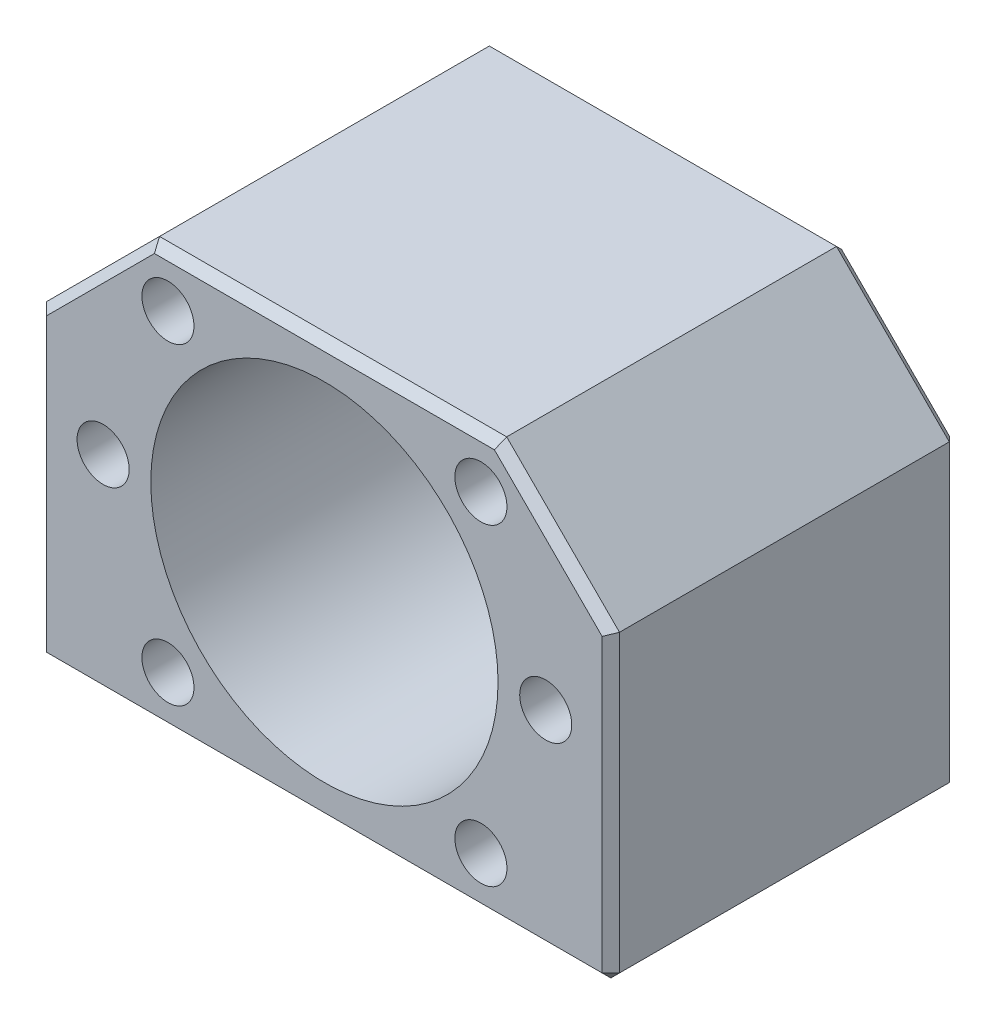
ISO-10303-21;
HEADER;
FILE_DESCRIPTION(('STEP AP214'),'2;1');
FILE_NAME('part.step','',(''),(''),'','','');
FILE_SCHEMA(('AUTOMOTIVE_DESIGN { 1 0 10303 214 1 1 1 1 }'));
ENDSEC;
DATA;
#1=APPLICATION_CONTEXT('core data for automotive mechanical design processes');
#2=APPLICATION_PROTOCOL_DEFINITION('international standard','automotive_design',2000,#1);
#3=PRODUCT_CONTEXT('',#1,'mechanical');
#4=PRODUCT('Part','Part','',(#3));
#5=PRODUCT_RELATED_PRODUCT_CATEGORY('part','',(#4));
#6=PRODUCT_DEFINITION_FORMATION('','',#4);
#7=PRODUCT_DEFINITION_CONTEXT('part definition',#1,'design');
#8=PRODUCT_DEFINITION('design','',#6,#7);
#9=PRODUCT_DEFINITION_SHAPE('','',#8);
#10=(LENGTH_UNIT() NAMED_UNIT(*) SI_UNIT(.MILLI.,.METRE.));
#11=(NAMED_UNIT(*) PLANE_ANGLE_UNIT() SI_UNIT($,.RADIAN.));
#12=(NAMED_UNIT(*) SI_UNIT($,.STERADIAN.) SOLID_ANGLE_UNIT());
#13=UNCERTAINTY_MEASURE_WITH_UNIT(LENGTH_MEASURE(1.E-05),#10,'distance_accuracy_value','');
#14=(GEOMETRIC_REPRESENTATION_CONTEXT(3) GLOBAL_UNCERTAINTY_ASSIGNED_CONTEXT((#13)) GLOBAL_UNIT_ASSIGNED_CONTEXT((#10,
#11,#12)) REPRESENTATION_CONTEXT('',''));
#15=CARTESIAN_POINT('',(0.,0.,0.));
#16=DIRECTION('',(0.,0.,1.));
#17=DIRECTION('',(1.,0.,0.));
#18=AXIS2_PLACEMENT_3D('',#15,#16,#17);
#19=CARTESIAN_POINT('',(25.,-9.,-8.));
#20=DIRECTION('',(0.,-1.,0.));
#21=DIRECTION('',(0.,0.,-1.));
#22=AXIS2_PLACEMENT_3D('',#19,#20,#21);
#23=PLANE('',#22);
#24=CARTESIAN_POINT('',(25.,-9.,-8.));
#25=DIRECTION('',(0.,1.,0.));
#26=DIRECTION('',(0.,0.,1.));
#27=AXIS2_PLACEMENT_3D('',#24,#25,#26);
#28=CIRCLE('',#27,3.);
#29=CARTESIAN_POINT('',(25.,-9.,-5.));
#30=VERTEX_POINT('',#29);
#31=EDGE_CURVE('E18',#30,#30,#28,.F.);
#32=ORIENTED_EDGE('',*,*,#31,.T.);
#33=EDGE_LOOP('',(#32));
#34=FACE_BOUND('',#33,.T.);
#35=ADVANCED_FACE('F15',(#34),#23,.T.);
#36=CARTESIAN_POINT('',(-25.,-9.,-32.));
#37=DIRECTION('',(0.,-1.,0.));
#38=DIRECTION('',(0.,0.,-1.));
#39=AXIS2_PLACEMENT_3D('',#36,#37,#38);
#40=PLANE('',#39);
#41=CARTESIAN_POINT('',(-25.,-9.,-32.));
#42=DIRECTION('',(0.,1.,0.));
#43=DIRECTION('',(0.,0.,1.));
#44=AXIS2_PLACEMENT_3D('',#41,#42,#43);
#45=CIRCLE('',#44,3.);
#46=CARTESIAN_POINT('',(-25.,-9.,-29.));
#47=VERTEX_POINT('',#46);
#48=EDGE_CURVE('E277',#47,#47,#45,.F.);
#49=ORIENTED_EDGE('',*,*,#48,.T.);
#50=EDGE_LOOP('',(#49));
#51=FACE_BOUND('',#50,.T.);
#52=ADVANCED_FACE('F903',(#51),#40,.T.);
#53=CARTESIAN_POINT('',(25.,-9.,-32.));
#54=DIRECTION('',(0.,-1.,0.));
#55=DIRECTION('',(0.,0.,-1.));
#56=AXIS2_PLACEMENT_3D('',#53,#54,#55);
#57=PLANE('',#56);
#58=CARTESIAN_POINT('',(25.,-9.,-32.));
#59=DIRECTION('',(0.,1.,0.));
#60=DIRECTION('',(0.,0.,1.));
#61=AXIS2_PLACEMENT_3D('',#58,#59,#60);
#62=CIRCLE('',#61,3.);
#63=CARTESIAN_POINT('',(25.,-9.,-29.));
#64=VERTEX_POINT('',#63);
#65=EDGE_CURVE('E274',#64,#64,#62,.F.);
#66=ORIENTED_EDGE('',*,*,#65,.T.);
#67=EDGE_LOOP('',(#66));
#68=FACE_BOUND('',#67,.T.);
#69=ADVANCED_FACE('F893',(#68),#57,.T.);
#70=CARTESIAN_POINT('',(-25.,-9.,-8.));
#71=DIRECTION('',(0.,-1.,0.));
#72=DIRECTION('',(0.,0.,-1.));
#73=AXIS2_PLACEMENT_3D('',#70,#71,#72);
#74=PLANE('',#73);
#75=CARTESIAN_POINT('',(-25.,-9.,-8.));
#76=DIRECTION('',(0.,1.,0.));
#77=DIRECTION('',(0.,0.,1.));
#78=AXIS2_PLACEMENT_3D('',#75,#76,#77);
#79=CIRCLE('',#78,3.);
#80=CARTESIAN_POINT('',(-25.,-9.,-5.));
#81=VERTEX_POINT('',#80);
#82=EDGE_CURVE('E150',#81,#81,#79,.F.);
#83=ORIENTED_EDGE('',*,*,#82,.T.);
#84=EDGE_LOOP('',(#83));
#85=FACE_BOUND('',#84,.T.);
#86=ADVANCED_FACE('F883',(#85),#74,.T.);
#87=CARTESIAN_POINT('',(-32.5,-23.5,0.));
#88=DIRECTION('',(-0.707106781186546,-0.707106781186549,0.));
#89=DIRECTION('',(0.707106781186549,-0.707106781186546,0.));
#90=AXIS2_PLACEMENT_3D('',#87,#88,#89);
#91=PLANE('',#90);
#92=DIRECTION('',(0.707106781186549,-0.707106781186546,0.));
#93=VECTOR('',#92,1.);
#94=CARTESIAN_POINT('',(-33.,-23.,-1.));
#95=LINE('',#94,#93);
#96=CARTESIAN_POINT('',(-33.,-23.,-1.));
#97=VERTEX_POINT('',#96);
#98=CARTESIAN_POINT('',(-32.,-24.,-1.));
#99=VERTEX_POINT('',#98);
#100=EDGE_CURVE('E195',#97,#99,#95,.T.);
#101=ORIENTED_EDGE('',*,*,#100,.F.);
#102=DIRECTION('',(0.,0.,1.));
#103=VECTOR('',#102,1.);
#104=CARTESIAN_POINT('',(-33.,-23.,0.));
#105=LINE('',#104,#103);
#106=CARTESIAN_POINT('',(-33.,-23.,-39.));
#107=VERTEX_POINT('',#106);
#108=EDGE_CURVE('E198',#107,#97,#105,.T.);
#109=ORIENTED_EDGE('',*,*,#108,.F.);
#110=DIRECTION('',(-0.707106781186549,0.707106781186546,0.));
#111=VECTOR('',#110,1.);
#112=CARTESIAN_POINT('',(-32.,-24.,-39.));
#113=LINE('',#112,#111);
#114=CARTESIAN_POINT('',(-32.,-24.,-39.));
#115=VERTEX_POINT('',#114);
#116=EDGE_CURVE('E149',#115,#107,#113,.T.);
#117=ORIENTED_EDGE('',*,*,#116,.F.);
#118=DIRECTION('',(0.,0.,-1.));
#119=VECTOR('',#118,1.);
#120=CARTESIAN_POINT('',(-32.,-24.,0.));
#121=LINE('',#120,#119);
#122=EDGE_CURVE('E192',#99,#115,#121,.T.);
#123=ORIENTED_EDGE('',*,*,#122,.F.);
#124=EDGE_LOOP('',(#101,#109,#117,#123));
#125=FACE_BOUND('',#124,.T.);
#126=ADVANCED_FACE('F291',(#125),#91,.T.);
#127=CARTESIAN_POINT('',(25.,-24.,-8.));
#128=DIRECTION('',(0.,1.,0.));
#129=DIRECTION('',(0.,0.,1.));
#130=AXIS2_PLACEMENT_3D('',#127,#128,#129);
#131=CYLINDRICAL_SURFACE('',#130,3.);
#132=ORIENTED_EDGE('',*,*,#31,.F.);
#133=EDGE_LOOP('',(#132));
#134=FACE_BOUND('',#133,.T.);
#135=CARTESIAN_POINT('',(25.,-24.,-8.));
#136=DIRECTION('',(0.,1.,0.));
#137=DIRECTION('',(0.,0.,1.));
#138=AXIS2_PLACEMENT_3D('',#135,#136,#137);
#139=CIRCLE('',#138,3.);
#140=CARTESIAN_POINT('',(25.,-24.,-5.));
#141=VERTEX_POINT('',#140);
#142=EDGE_CURVE('E191',#141,#141,#139,.T.);
#143=ORIENTED_EDGE('',*,*,#142,.F.);
#144=EDGE_LOOP('',(#143));
#145=FACE_BOUND('',#144,.T.);
#146=ADVANCED_FACE('F287',(#134,#145),#131,.F.);
#147=CARTESIAN_POINT('',(-25.,-24.,-32.));
#148=DIRECTION('',(0.,1.,0.));
#149=DIRECTION('',(0.,0.,1.));
#150=AXIS2_PLACEMENT_3D('',#147,#148,#149);
#151=CYLINDRICAL_SURFACE('',#150,3.);
#152=ORIENTED_EDGE('',*,*,#48,.F.);
#153=EDGE_LOOP('',(#152));
#154=FACE_BOUND('',#153,.T.);
#155=CARTESIAN_POINT('',(-25.,-24.,-32.));
#156=DIRECTION('',(0.,1.,0.));
#157=DIRECTION('',(0.,0.,1.));
#158=AXIS2_PLACEMENT_3D('',#155,#156,#157);
#159=CIRCLE('',#158,3.);
#160=CARTESIAN_POINT('',(-25.,-24.,-29.));
#161=VERTEX_POINT('',#160);
#162=EDGE_CURVE('E264',#161,#161,#159,.T.);
#163=ORIENTED_EDGE('',*,*,#162,.F.);
#164=EDGE_LOOP('',(#163));
#165=FACE_BOUND('',#164,.T.);
#166=ADVANCED_FACE('F290',(#154,#165),#151,.F.);
#167=CARTESIAN_POINT('',(25.,-24.,-32.));
#168=DIRECTION('',(0.,1.,0.));
#169=DIRECTION('',(0.,0.,1.));
#170=AXIS2_PLACEMENT_3D('',#167,#168,#169);
#171=CYLINDRICAL_SURFACE('',#170,3.);
#172=ORIENTED_EDGE('',*,*,#65,.F.);
#173=EDGE_LOOP('',(#172));
#174=FACE_BOUND('',#173,.T.);
#175=CARTESIAN_POINT('',(25.,-24.,-32.));
#176=DIRECTION('',(0.,1.,0.));
#177=DIRECTION('',(0.,0.,1.));
#178=AXIS2_PLACEMENT_3D('',#175,#176,#177);
#179=CIRCLE('',#178,3.);
#180=CARTESIAN_POINT('',(25.,-24.,-29.));
#181=VERTEX_POINT('',#180);
#182=EDGE_CURVE('E260',#181,#181,#179,.T.);
#183=ORIENTED_EDGE('',*,*,#182,.F.);
#184=EDGE_LOOP('',(#183));
#185=FACE_BOUND('',#184,.T.);
#186=ADVANCED_FACE('F849',(#174,#185),#171,.F.);
#187=CARTESIAN_POINT('',(-25.,-24.,-8.));
#188=DIRECTION('',(0.,1.,0.));
#189=DIRECTION('',(0.,0.,1.));
#190=AXIS2_PLACEMENT_3D('',#187,#188,#189);
#191=CYLINDRICAL_SURFACE('',#190,3.);
#192=ORIENTED_EDGE('',*,*,#82,.F.);
#193=EDGE_LOOP('',(#192));
#194=FACE_BOUND('',#193,.T.);
#195=CARTESIAN_POINT('',(-25.,-24.,-8.));
#196=DIRECTION('',(0.,1.,0.));
#197=DIRECTION('',(0.,0.,1.));
#198=AXIS2_PLACEMENT_3D('',#195,#196,#197);
#199=CIRCLE('',#198,3.);
#200=CARTESIAN_POINT('',(-25.,-24.,-5.));
#201=VERTEX_POINT('',#200);
#202=EDGE_CURVE('E188',#201,#201,#199,.T.);
#203=ORIENTED_EDGE('',*,*,#202,.F.);
#204=EDGE_LOOP('',(#203));
#205=FACE_BOUND('',#204,.T.);
#206=ADVANCED_FACE('F840',(#194,#205),#191,.F.);
#207=CARTESIAN_POINT('',(32.5,-23.5,0.));
#208=DIRECTION('',(0.707106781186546,-0.707106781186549,0.));
#209=DIRECTION('',(0.707106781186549,0.707106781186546,0.));
#210=AXIS2_PLACEMENT_3D('',#207,#208,#209);
#211=PLANE('',#210);
#212=DIRECTION('',(0.707106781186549,0.707106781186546,0.));
#213=VECTOR('',#212,1.);
#214=CARTESIAN_POINT('',(32.,-24.,-1.));
#215=LINE('',#214,#213);
#216=CARTESIAN_POINT('',(32.,-24.,-1.));
#217=VERTEX_POINT('',#216);
#218=CARTESIAN_POINT('',(33.,-23.,-0.999999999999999));
#219=VERTEX_POINT('',#218);
#220=EDGE_CURVE('E126',#217,#219,#215,.T.);
#221=ORIENTED_EDGE('',*,*,#220,.F.);
#222=DIRECTION('',(0.,0.,-1.));
#223=VECTOR('',#222,1.);
#224=CARTESIAN_POINT('',(32.,-24.,0.));
#225=LINE('',#224,#223);
#226=CARTESIAN_POINT('',(32.,-24.,-39.));
#227=VERTEX_POINT('',#226);
#228=EDGE_CURVE('E143',#227,#217,#225,.F.);
#229=ORIENTED_EDGE('',*,*,#228,.F.);
#230=DIRECTION('',(-0.707106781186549,-0.707106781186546,0.));
#231=VECTOR('',#230,1.);
#232=CARTESIAN_POINT('',(33.,-23.,-39.));
#233=LINE('',#232,#231);
#234=CARTESIAN_POINT('',(33.,-23.,-39.));
#235=VERTEX_POINT('',#234);
#236=EDGE_CURVE('E141',#235,#227,#233,.T.);
#237=ORIENTED_EDGE('',*,*,#236,.F.);
#238=DIRECTION('',(0.,0.,-1.));
#239=VECTOR('',#238,1.);
#240=CARTESIAN_POINT('',(33.,-23.,0.));
#241=LINE('',#240,#239);
#242=EDGE_CURVE('E115',#219,#235,#241,.T.);
#243=ORIENTED_EDGE('',*,*,#242,.F.);
#244=EDGE_LOOP('',(#221,#229,#237,#243));
#245=FACE_BOUND('',#244,.T.);
#246=ADVANCED_FACE('F142',(#245),#211,.T.);
#247=CARTESIAN_POINT('',(32.,-24.,-39.));
#248=DIRECTION('',(0.577350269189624,-0.577350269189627,-0.577350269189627));
#249=DIRECTION('',(0.,0.707106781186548,-0.707106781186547));
#250=AXIS2_PLACEMENT_3D('',#247,#248,#249);
#251=PLANE('',#250);
#252=ORIENTED_EDGE('',*,*,#236,.T.);
#253=DIRECTION('',(0.,0.707106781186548,-0.707106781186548));
#254=VECTOR('',#253,1.);
#255=CARTESIAN_POINT('',(32.,-23.5,-39.5));
#256=LINE('',#255,#254);
#257=CARTESIAN_POINT('',(32.,-23.,-40.));
#258=VERTEX_POINT('',#257);
#259=EDGE_CURVE('E153',#258,#227,#256,.F.);
#260=ORIENTED_EDGE('',*,*,#259,.F.);
#261=DIRECTION('',(-0.707106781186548,0.,-0.707106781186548));
#262=VECTOR('',#261,1.);
#263=CARTESIAN_POINT('',(32.5,-23.,-39.5));
#264=LINE('',#263,#262);
#265=EDGE_CURVE('E133',#235,#258,#264,.T.);
#266=ORIENTED_EDGE('',*,*,#265,.F.);
#267=EDGE_LOOP('',(#252,#260,#266));
#268=FACE_BOUND('',#267,.T.);
#269=ADVANCED_FACE('F152',(#268),#251,.T.);
#270=CARTESIAN_POINT('',(-33.,-23.,-39.));
#271=DIRECTION('',(-0.577350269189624,-0.577350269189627,-0.577350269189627));
#272=DIRECTION('',(0.,0.707106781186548,-0.707106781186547));
#273=AXIS2_PLACEMENT_3D('',#270,#271,#272);
#274=PLANE('',#273);
#275=ORIENTED_EDGE('',*,*,#116,.T.);
#276=DIRECTION('',(-0.707106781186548,0.,0.707106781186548));
#277=VECTOR('',#276,1.);
#278=CARTESIAN_POINT('',(-32.5,-23.,-39.5));
#279=LINE('',#278,#277);
#280=CARTESIAN_POINT('',(-32.,-23.,-40.));
#281=VERTEX_POINT('',#280);
#282=EDGE_CURVE('E310',#281,#107,#279,.T.);
#283=ORIENTED_EDGE('',*,*,#282,.F.);
#284=DIRECTION('',(0.,0.707106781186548,-0.707106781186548));
#285=VECTOR('',#284,1.);
#286=CARTESIAN_POINT('',(-32.,-23.5,-39.5));
#287=LINE('',#286,#285);
#288=EDGE_CURVE('E159',#115,#281,#287,.T.);
#289=ORIENTED_EDGE('',*,*,#288,.F.);
#290=EDGE_LOOP('',(#275,#283,#289));
#291=FACE_BOUND('',#290,.T.);
#292=ADVANCED_FACE('F334',(#291),#274,.T.);
#293=CARTESIAN_POINT('',(-33.,-24.,0.));
#294=DIRECTION('',(-1.,0.,0.));
#295=DIRECTION('',(0.,0.,1.));
#296=AXIS2_PLACEMENT_3D('',#293,#294,#295);
#297=PLANE('',#296);
#298=DIRECTION('',(0.,1.,0.));
#299=VECTOR('',#298,1.);
#300=CARTESIAN_POINT('',(-33.,-12.,-1.));
#301=LINE('',#300,#299);
#302=CARTESIAN_POINT('',(-33.,11.,-1.));
#303=VERTEX_POINT('',#302);
#304=EDGE_CURVE('E400',#303,#97,#301,.F.);
#305=ORIENTED_EDGE('',*,*,#304,.F.);
#306=DIRECTION('',(0.,0.,1.));
#307=VECTOR('',#306,1.);
#308=CARTESIAN_POINT('',(-33.,11.,0.));
#309=LINE('',#308,#307);
#310=CARTESIAN_POINT('',(-33.,11.,-39.));
#311=VERTEX_POINT('',#310);
#312=EDGE_CURVE('E177',#311,#303,#309,.T.);
#313=ORIENTED_EDGE('',*,*,#312,.F.);
#314=DIRECTION('',(0.,1.,0.));
#315=VECTOR('',#314,1.);
#316=CARTESIAN_POINT('',(-33.,-12.,-39.));
#317=LINE('',#316,#315);
#318=EDGE_CURVE('E315',#107,#311,#317,.T.);
#319=ORIENTED_EDGE('',*,*,#318,.F.);
#320=ORIENTED_EDGE('',*,*,#108,.T.);
#321=EDGE_LOOP('',(#305,#313,#319,#320));
#322=FACE_BOUND('',#321,.T.);
#323=ADVANCED_FACE('F421',(#322),#297,.T.);
#324=CARTESIAN_POINT('',(-33.,-23.,-1.));
#325=DIRECTION('',(-0.577350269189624,-0.577350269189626,0.577350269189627));
#326=DIRECTION('',(0.,-0.707106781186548,-0.707106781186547));
#327=AXIS2_PLACEMENT_3D('',#324,#325,#326);
#328=PLANE('',#327);
#329=DIRECTION('',(0.707106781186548,0.,0.707106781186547));
#330=VECTOR('',#329,1.);
#331=CARTESIAN_POINT('',(-32.5,-23.,-0.5));
#332=LINE('',#331,#330);
#333=CARTESIAN_POINT('',(-32.,-23.,0.));
#334=VERTEX_POINT('',#333);
#335=EDGE_CURVE('E397',#97,#334,#332,.T.);
#336=ORIENTED_EDGE('',*,*,#335,.F.);
#337=ORIENTED_EDGE('',*,*,#100,.T.);
#338=DIRECTION('',(0.,-0.707106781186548,-0.707106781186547));
#339=VECTOR('',#338,1.);
#340=CARTESIAN_POINT('',(-32.,-23.5,-0.5));
#341=LINE('',#340,#339);
#342=EDGE_CURVE('E390',#334,#99,#341,.T.);
#343=ORIENTED_EDGE('',*,*,#342,.F.);
#344=EDGE_LOOP('',(#336,#337,#343));
#345=FACE_BOUND('',#344,.T.);
#346=ADVANCED_FACE('F299',(#345),#328,.T.);
#347=CARTESIAN_POINT('',(33.,-24.,0.));
#348=DIRECTION('',(0.,-1.,0.));
#349=DIRECTION('',(0.,0.,-1.));
#350=AXIS2_PLACEMENT_3D('',#347,#348,#349);
#351=PLANE('',#350);
#352=ORIENTED_EDGE('',*,*,#202,.T.);
#353=EDGE_LOOP('',(#352));
#354=FACE_BOUND('',#353,.T.);
#355=ORIENTED_EDGE('',*,*,#182,.T.);
#356=EDGE_LOOP('',(#355));
#357=FACE_BOUND('',#356,.T.);
#358=ORIENTED_EDGE('',*,*,#162,.T.);
#359=EDGE_LOOP('',(#358));
#360=FACE_BOUND('',#359,.T.);
#361=ORIENTED_EDGE('',*,*,#142,.T.);
#362=EDGE_LOOP('',(#361));
#363=FACE_BOUND('',#362,.T.);
#364=DIRECTION('',(1.,0.,0.));
#365=VECTOR('',#364,1.);
#366=CARTESIAN_POINT('',(16.5,-24.,-39.));
#367=LINE('',#366,#365);
#368=EDGE_CURVE('E303',#227,#115,#367,.F.);
#369=ORIENTED_EDGE('',*,*,#368,.F.);
#370=ORIENTED_EDGE('',*,*,#228,.T.);
#371=DIRECTION('',(1.,0.,0.));
#372=VECTOR('',#371,1.);
#373=CARTESIAN_POINT('',(16.5,-24.,-1.));
#374=LINE('',#373,#372);
#375=EDGE_CURVE('E386',#99,#217,#374,.T.);
#376=ORIENTED_EDGE('',*,*,#375,.F.);
#377=ORIENTED_EDGE('',*,*,#122,.T.);
#378=EDGE_LOOP('',(#369,#370,#376,#377));
#379=FACE_BOUND('',#378,.T.);
#380=ADVANCED_FACE('F295',(#354,#357,#360,#363,#379),#351,.T.);
#381=CARTESIAN_POINT('',(32.,-23.,0.));
#382=DIRECTION('',(0.577350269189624,-0.577350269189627,0.577350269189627));
#383=DIRECTION('',(0.,-0.707106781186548,-0.707106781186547));
#384=AXIS2_PLACEMENT_3D('',#381,#382,#383);
#385=PLANE('',#384);
#386=DIRECTION('',(0.707106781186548,0.,-0.707106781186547));
#387=VECTOR('',#386,1.);
#388=CARTESIAN_POINT('',(32.5,-23.,-0.5));
#389=LINE('',#388,#387);
#390=CARTESIAN_POINT('',(32.,-23.,0.));
#391=VERTEX_POINT('',#390);
#392=EDGE_CURVE('E382',#391,#219,#389,.T.);
#393=ORIENTED_EDGE('',*,*,#392,.F.);
#394=DIRECTION('',(0.,-0.707106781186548,-0.707106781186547));
#395=VECTOR('',#394,1.);
#396=CARTESIAN_POINT('',(32.,-23.5,-0.5));
#397=LINE('',#396,#395);
#398=EDGE_CURVE('E394',#217,#391,#397,.F.);
#399=ORIENTED_EDGE('',*,*,#398,.F.);
#400=ORIENTED_EDGE('',*,*,#220,.T.);
#401=EDGE_LOOP('',(#393,#399,#400));
#402=FACE_BOUND('',#401,.T.);
#403=ADVANCED_FACE('F298',(#402),#385,.T.);
#404=CARTESIAN_POINT('',(33.,24.,0.));
#405=DIRECTION('',(1.,0.,0.));
#406=DIRECTION('',(0.,0.,-1.));
#407=AXIS2_PLACEMENT_3D('',#404,#405,#406);
#408=PLANE('',#407);
#409=DIRECTION('',(0.,1.,0.));
#410=VECTOR('',#409,1.);
#411=CARTESIAN_POINT('',(33.,12.,-1.));
#412=LINE('',#411,#410);
#413=CARTESIAN_POINT('',(33.,11.,-1.));
#414=VERTEX_POINT('',#413);
#415=EDGE_CURVE('E120',#219,#414,#412,.T.);
#416=ORIENTED_EDGE('',*,*,#415,.F.);
#417=ORIENTED_EDGE('',*,*,#242,.T.);
#418=DIRECTION('',(0.,1.,0.));
#419=VECTOR('',#418,1.);
#420=CARTESIAN_POINT('',(33.,12.,-39.));
#421=LINE('',#420,#419);
#422=CARTESIAN_POINT('',(33.,11.,-39.));
#423=VERTEX_POINT('',#422);
#424=EDGE_CURVE('E119',#423,#235,#421,.F.);
#425=ORIENTED_EDGE('',*,*,#424,.F.);
#426=DIRECTION('',(0.,0.,1.));
#427=VECTOR('',#426,1.);
#428=CARTESIAN_POINT('',(33.,11.,0.));
#429=LINE('',#428,#427);
#430=EDGE_CURVE('E125',#414,#423,#429,.F.);
#431=ORIENTED_EDGE('',*,*,#430,.F.);
#432=EDGE_LOOP('',(#416,#417,#425,#431));
#433=FACE_BOUND('',#432,.T.);
#434=ADVANCED_FACE('F117',(#433),#408,.T.);
#435=CARTESIAN_POINT('',(26.5,17.5,0.));
#436=DIRECTION('',(0.707106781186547,0.707106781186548,0.));
#437=DIRECTION('',(-0.707106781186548,0.707106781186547,0.));
#438=AXIS2_PLACEMENT_3D('',#435,#436,#437);
#439=PLANE('',#438);
#440=DIRECTION('',(-0.707106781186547,0.707106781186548,0.));
#441=VECTOR('',#440,1.);
#442=CARTESIAN_POINT('',(33.,11.,-1.00000000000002));
#443=LINE('',#442,#441);
#444=CARTESIAN_POINT('',(20.,24.,-1.00000000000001));
#445=VERTEX_POINT('',#444);
#446=EDGE_CURVE('E373',#414,#445,#443,.T.);
#447=ORIENTED_EDGE('',*,*,#446,.F.);
#448=ORIENTED_EDGE('',*,*,#430,.T.);
#449=DIRECTION('',(0.707106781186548,-0.707106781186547,0.));
#450=VECTOR('',#449,1.);
#451=CARTESIAN_POINT('',(20.,24.,-39.));
#452=LINE('',#451,#450);
#453=CARTESIAN_POINT('',(20.,24.,-39.));
#454=VERTEX_POINT('',#453);
#455=EDGE_CURVE('E166',#454,#423,#452,.T.);
#456=ORIENTED_EDGE('',*,*,#455,.F.);
#457=DIRECTION('',(0.,0.,1.));
#458=VECTOR('',#457,1.);
#459=CARTESIAN_POINT('',(20.,24.,0.));
#460=LINE('',#459,#458);
#461=EDGE_CURVE('E180',#445,#454,#460,.F.);
#462=ORIENTED_EDGE('',*,*,#461,.F.);
#463=EDGE_LOOP('',(#447,#448,#456,#462));
#464=FACE_BOUND('',#463,.T.);
#465=ADVANCED_FACE('F443',(#464),#439,.T.);
#466=CARTESIAN_POINT('',(-33.,24.,0.));
#467=DIRECTION('',(0.,1.,0.));
#468=DIRECTION('',(0.,0.,1.));
#469=AXIS2_PLACEMENT_3D('',#466,#467,#468);
#470=PLANE('',#469);
#471=DIRECTION('',(1.,0.,0.));
#472=VECTOR('',#471,1.);
#473=CARTESIAN_POINT('',(-16.5,24.,-1.));
#474=LINE('',#473,#472);
#475=CARTESIAN_POINT('',(-20.,24.,-1.));
#476=VERTEX_POINT('',#475);
#477=EDGE_CURVE('E366',#445,#476,#474,.F.);
#478=ORIENTED_EDGE('',*,*,#477,.F.);
#479=ORIENTED_EDGE('',*,*,#461,.T.);
#480=DIRECTION('',(1.,0.,0.));
#481=VECTOR('',#480,1.);
#482=CARTESIAN_POINT('',(-16.5,24.,-39.));
#483=LINE('',#482,#481);
#484=CARTESIAN_POINT('',(-20.,24.,-39.));
#485=VERTEX_POINT('',#484);
#486=EDGE_CURVE('E170',#485,#454,#483,.T.);
#487=ORIENTED_EDGE('',*,*,#486,.F.);
#488=DIRECTION('',(0.,0.,1.));
#489=VECTOR('',#488,1.);
#490=CARTESIAN_POINT('',(-20.,24.,0.));
#491=LINE('',#490,#489);
#492=EDGE_CURVE('E174',#476,#485,#491,.F.);
#493=ORIENTED_EDGE('',*,*,#492,.F.);
#494=EDGE_LOOP('',(#478,#479,#487,#493));
#495=FACE_BOUND('',#494,.T.);
#496=ADVANCED_FACE('F429',(#495),#470,.T.);
#497=CARTESIAN_POINT('',(-26.5,17.5,0.));
#498=DIRECTION('',(-0.707106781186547,0.707106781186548,0.));
#499=DIRECTION('',(-0.707106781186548,-0.707106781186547,0.));
#500=AXIS2_PLACEMENT_3D('',#497,#498,#499);
#501=PLANE('',#500);
#502=DIRECTION('',(-0.707106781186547,-0.707106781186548,0.));
#503=VECTOR('',#502,1.);
#504=CARTESIAN_POINT('',(-20.,24.,-1.00000000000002));
#505=LINE('',#504,#503);
#506=EDGE_CURVE('E362',#476,#303,#505,.T.);
#507=ORIENTED_EDGE('',*,*,#506,.F.);
#508=ORIENTED_EDGE('',*,*,#492,.T.);
#509=DIRECTION('',(0.707106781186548,0.707106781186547,0.));
#510=VECTOR('',#509,1.);
#511=CARTESIAN_POINT('',(-33.,11.,-39.));
#512=LINE('',#511,#510);
#513=EDGE_CURVE('E407',#311,#485,#512,.T.);
#514=ORIENTED_EDGE('',*,*,#513,.F.);
#515=ORIENTED_EDGE('',*,*,#312,.T.);
#516=EDGE_LOOP('',(#507,#508,#514,#515));
#517=FACE_BOUND('',#516,.T.);
#518=ADVANCED_FACE('F425',(#517),#501,.T.);
#519=CARTESIAN_POINT('',(-25.5,0.,-15.));
#520=DIRECTION('',(0.,0.,1.));
#521=DIRECTION('',(1.,0.,0.));
#522=AXIS2_PLACEMENT_3D('',#519,#520,#521);
#523=PLANE('',#522);
#524=CARTESIAN_POINT('',(-25.5,0.,-15.));
#525=DIRECTION('',(0.,0.,-1.));
#526=DIRECTION('',(-1.,0.,0.));
#527=AXIS2_PLACEMENT_3D('',#524,#525,#526);
#528=CIRCLE('',#527,3.);
#529=CARTESIAN_POINT('',(-28.5,0.,-15.));
#530=VERTEX_POINT('',#529);
#531=EDGE_CURVE('E252',#530,#530,#528,.F.);
#532=ORIENTED_EDGE('',*,*,#531,.T.);
#533=EDGE_LOOP('',(#532));
#534=FACE_BOUND('',#533,.T.);
#535=ADVANCED_FACE('F741',(#534),#523,.T.);
#536=CARTESIAN_POINT('',(18.4100076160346,18.4100076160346,-15.));
#537=DIRECTION('',(0.,0.,1.));
#538=DIRECTION('',(1.,0.,0.));
#539=AXIS2_PLACEMENT_3D('',#536,#537,#538);
#540=PLANE('',#539);
#541=CARTESIAN_POINT('',(18.031222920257,18.031222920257,-15.));
#542=DIRECTION('',(0.,0.,-1.));
#543=DIRECTION('',(-1.,0.,0.));
#544=AXIS2_PLACEMENT_3D('',#541,#542,#543);
#545=CIRCLE('',#544,3.);
#546=CARTESIAN_POINT('',(15.031222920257,18.031222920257,-15.));
#547=VERTEX_POINT('',#546);
#548=EDGE_CURVE('E248',#547,#547,#545,.F.);
#549=ORIENTED_EDGE('',*,*,#548,.T.);
#550=EDGE_LOOP('',(#549));
#551=FACE_BOUND('',#550,.T.);
#552=ADVANCED_FACE('F731',(#551),#540,.T.);
#553=CARTESIAN_POINT('',(-18.031222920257,-18.031222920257,-15.));
#554=DIRECTION('',(0.,0.,1.));
#555=DIRECTION('',(1.,0.,0.));
#556=AXIS2_PLACEMENT_3D('',#553,#554,#555);
#557=PLANE('',#556);
#558=CARTESIAN_POINT('',(-18.031222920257,-18.031222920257,-15.));
#559=DIRECTION('',(0.,0.,-1.));
#560=DIRECTION('',(-1.,0.,0.));
#561=AXIS2_PLACEMENT_3D('',#558,#559,#560);
#562=CIRCLE('',#561,3.);
#563=CARTESIAN_POINT('',(-21.031222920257,-18.031222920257,-15.));
#564=VERTEX_POINT('',#563);
#565=EDGE_CURVE('E244',#564,#564,#562,.F.);
#566=ORIENTED_EDGE('',*,*,#565,.T.);
#567=EDGE_LOOP('',(#566));
#568=FACE_BOUND('',#567,.T.);
#569=ADVANCED_FACE('F721',(#568),#557,.T.);
#570=CARTESIAN_POINT('',(-18.031222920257,18.031222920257,-15.));
#571=DIRECTION('',(0.,0.,1.));
#572=DIRECTION('',(1.,0.,0.));
#573=AXIS2_PLACEMENT_3D('',#570,#571,#572);
#574=PLANE('',#573);
#575=CARTESIAN_POINT('',(-18.031222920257,18.031222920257,-15.));
#576=DIRECTION('',(0.,0.,-1.));
#577=DIRECTION('',(-1.,0.,0.));
#578=AXIS2_PLACEMENT_3D('',#575,#576,#577);
#579=CIRCLE('',#578,3.);
#580=CARTESIAN_POINT('',(-21.031222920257,18.031222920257,-15.));
#581=VERTEX_POINT('',#580);
#582=EDGE_CURVE('E240',#581,#581,#579,.F.);
#583=ORIENTED_EDGE('',*,*,#582,.T.);
#584=EDGE_LOOP('',(#583));
#585=FACE_BOUND('',#584,.T.);
#586=ADVANCED_FACE('F711',(#585),#574,.T.);
#587=CARTESIAN_POINT('',(25.5,0.,-15.));
#588=DIRECTION('',(0.,0.,1.));
#589=DIRECTION('',(1.,0.,0.));
#590=AXIS2_PLACEMENT_3D('',#587,#588,#589);
#591=PLANE('',#590);
#592=CARTESIAN_POINT('',(25.5,0.,-15.));
#593=DIRECTION('',(0.,0.,-1.));
#594=DIRECTION('',(-1.,0.,0.));
#595=AXIS2_PLACEMENT_3D('',#592,#593,#594);
#596=CIRCLE('',#595,3.);
#597=CARTESIAN_POINT('',(22.5,0.,-15.));
#598=VERTEX_POINT('',#597);
#599=EDGE_CURVE('E236',#598,#598,#596,.F.);
#600=ORIENTED_EDGE('',*,*,#599,.T.);
#601=EDGE_LOOP('',(#600));
#602=FACE_BOUND('',#601,.T.);
#603=ADVANCED_FACE('F701',(#602),#591,.T.);
#604=CARTESIAN_POINT('',(18.031222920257,-18.031222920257,-15.));
#605=DIRECTION('',(0.,0.,1.));
#606=DIRECTION('',(1.,0.,0.));
#607=AXIS2_PLACEMENT_3D('',#604,#605,#606);
#608=PLANE('',#607);
#609=CARTESIAN_POINT('',(18.031222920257,-18.031222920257,-15.));
#610=DIRECTION('',(0.,0.,-1.));
#611=DIRECTION('',(-1.,0.,0.));
#612=AXIS2_PLACEMENT_3D('',#609,#610,#611);
#613=CIRCLE('',#612,3.);
#614=CARTESIAN_POINT('',(15.031222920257,-18.031222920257,-15.));
#615=VERTEX_POINT('',#614);
#616=EDGE_CURVE('E231',#615,#615,#613,.F.);
#617=ORIENTED_EDGE('',*,*,#616,.T.);
#618=EDGE_LOOP('',(#617));
#619=FACE_BOUND('',#618,.T.);
#620=ADVANCED_FACE('F459',(#619),#608,.T.);
#621=CARTESIAN_POINT('',(-16.5,23.5,-39.5));
#622=DIRECTION('',(0.,0.707106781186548,-0.707106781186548));
#623=DIRECTION('',(0.,0.707106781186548,0.707106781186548));
#624=AXIS2_PLACEMENT_3D('',#621,#622,#623);
#625=PLANE('',#624);
#626=ORIENTED_EDGE('',*,*,#486,.T.);
#627=DIRECTION('',(0.281084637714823,0.678598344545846,0.678598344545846));
#628=VECTOR('',#627,1.);
#629=CARTESIAN_POINT('',(19.5857864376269,23.,-40.));
#630=LINE('',#629,#628);
#631=CARTESIAN_POINT('',(19.5857864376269,23.,-40.));
#632=VERTEX_POINT('',#631);
#633=EDGE_CURVE('E138',#632,#454,#630,.T.);
#634=ORIENTED_EDGE('',*,*,#633,.F.);
#635=DIRECTION('',(-1.,0.,0.));
#636=VECTOR('',#635,1.);
#637=CARTESIAN_POINT('',(0.,23.,-40.));
#638=LINE('',#637,#636);
#639=CARTESIAN_POINT('',(-19.5857864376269,23.,-40.));
#640=VERTEX_POINT('',#639);
#641=EDGE_CURVE('E235',#640,#632,#638,.F.);
#642=ORIENTED_EDGE('',*,*,#641,.F.);
#643=DIRECTION('',(0.281084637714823,-0.678598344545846,-0.678598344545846));
#644=VECTOR('',#643,1.);
#645=CARTESIAN_POINT('',(-20.,24.,-39.));
#646=LINE('',#645,#644);
#647=EDGE_CURVE('E404',#485,#640,#646,.T.);
#648=ORIENTED_EDGE('',*,*,#647,.F.);
#649=EDGE_LOOP('',(#626,#634,#642,#648));
#650=FACE_BOUND('',#649,.T.);
#651=ADVANCED_FACE('F446',(#650),#625,.T.);
#652=CARTESIAN_POINT('',(23.8964466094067,19.3964466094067,-39.5));
#653=DIRECTION('',(0.500000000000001,0.500000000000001,-0.707106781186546));
#654=DIRECTION('',(0.,0.816496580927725,0.577350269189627));
#655=AXIS2_PLACEMENT_3D('',#652,#653,#654);
#656=PLANE('',#655);
#657=DIRECTION('',(0.707106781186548,-0.707106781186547,0.));
#658=VECTOR('',#657,1.);
#659=CARTESIAN_POINT('',(19.5857864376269,23.,-40.));
#660=LINE('',#659,#658);
#661=CARTESIAN_POINT('',(32.,10.5857864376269,-40.));
#662=VERTEX_POINT('',#661);
#663=EDGE_CURVE('E351',#632,#662,#660,.T.);
#664=ORIENTED_EDGE('',*,*,#663,.F.);
#665=ORIENTED_EDGE('',*,*,#633,.T.);
#666=ORIENTED_EDGE('',*,*,#455,.T.);
#667=DIRECTION('',(0.678598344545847,0.281084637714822,0.678598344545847));
#668=VECTOR('',#667,1.);
#669=CARTESIAN_POINT('',(32.,10.5857864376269,-40.));
#670=LINE('',#669,#668);
#671=EDGE_CURVE('E136',#662,#423,#670,.T.);
#672=ORIENTED_EDGE('',*,*,#671,.F.);
#673=EDGE_LOOP('',(#664,#665,#666,#672));
#674=FACE_BOUND('',#673,.T.);
#675=ADVANCED_FACE('F450',(#674),#656,.T.);
#676=CARTESIAN_POINT('',(32.5,12.,-39.5));
#677=DIRECTION('',(0.707106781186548,0.,-0.707106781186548));
#678=DIRECTION('',(-0.707106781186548,0.,-0.707106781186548));
#679=AXIS2_PLACEMENT_3D('',#676,#677,#678);
#680=PLANE('',#679);
#681=DIRECTION('',(0.,1.,0.));
#682=VECTOR('',#681,1.);
#683=CARTESIAN_POINT('',(32.,0.,-40.));
#684=LINE('',#683,#682);
#685=EDGE_CURVE('E331',#662,#258,#684,.F.);
#686=ORIENTED_EDGE('',*,*,#685,.F.);
#687=ORIENTED_EDGE('',*,*,#671,.T.);
#688=ORIENTED_EDGE('',*,*,#424,.T.);
#689=ORIENTED_EDGE('',*,*,#265,.T.);
#690=EDGE_LOOP('',(#686,#687,#688,#689));
#691=FACE_BOUND('',#690,.T.);
#692=ADVANCED_FACE('F131',(#691),#680,.T.);
#693=CARTESIAN_POINT('',(16.5,-23.5,-39.5));
#694=DIRECTION('',(0.,-0.707106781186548,-0.707106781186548));
#695=DIRECTION('',(0.,0.707106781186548,-0.707106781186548));
#696=AXIS2_PLACEMENT_3D('',#693,#694,#695);
#697=PLANE('',#696);
#698=ORIENTED_EDGE('',*,*,#259,.T.);
#699=ORIENTED_EDGE('',*,*,#368,.T.);
#700=ORIENTED_EDGE('',*,*,#288,.T.);
#701=DIRECTION('',(-1.,0.,0.));
#702=VECTOR('',#701,1.);
#703=CARTESIAN_POINT('',(0.,-23.,-40.));
#704=LINE('',#703,#702);
#705=EDGE_CURVE('E322',#258,#281,#704,.T.);
#706=ORIENTED_EDGE('',*,*,#705,.F.);
#707=EDGE_LOOP('',(#698,#699,#700,#706));
#708=FACE_BOUND('',#707,.T.);
#709=ADVANCED_FACE('F321',(#708),#697,.T.);
#710=CARTESIAN_POINT('',(-32.5,-12.,-39.5));
#711=DIRECTION('',(-0.707106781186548,0.,-0.707106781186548));
#712=DIRECTION('',(-0.707106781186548,0.,0.707106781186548));
#713=AXIS2_PLACEMENT_3D('',#710,#711,#712);
#714=PLANE('',#713);
#715=ORIENTED_EDGE('',*,*,#318,.T.);
#716=DIRECTION('',(-0.678598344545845,0.28108463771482,0.678598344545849));
#717=VECTOR('',#716,1.);
#718=CARTESIAN_POINT('',(-32.,10.5857864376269,-40.));
#719=LINE('',#718,#717);
#720=CARTESIAN_POINT('',(-32.,10.5857864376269,-40.));
#721=VERTEX_POINT('',#720);
#722=EDGE_CURVE('E339',#721,#311,#719,.T.);
#723=ORIENTED_EDGE('',*,*,#722,.F.);
#724=DIRECTION('',(0.,1.,0.));
#725=VECTOR('',#724,1.);
#726=CARTESIAN_POINT('',(-32.,0.,-40.));
#727=LINE('',#726,#725);
#728=EDGE_CURVE('E329',#281,#721,#727,.T.);
#729=ORIENTED_EDGE('',*,*,#728,.F.);
#730=ORIENTED_EDGE('',*,*,#282,.T.);
#731=EDGE_LOOP('',(#715,#723,#729,#730));
#732=FACE_BOUND('',#731,.T.);
#733=ADVANCED_FACE('F337',(#732),#714,.T.);
#734=CARTESIAN_POINT('',(-23.8964466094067,19.3964466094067,-39.5));
#735=DIRECTION('',(-0.500000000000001,0.500000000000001,-0.707106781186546));
#736=DIRECTION('',(0.,0.816496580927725,0.577350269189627));
#737=AXIS2_PLACEMENT_3D('',#734,#735,#736);
#738=PLANE('',#737);
#739=ORIENTED_EDGE('',*,*,#513,.T.);
#740=ORIENTED_EDGE('',*,*,#647,.T.);
#741=DIRECTION('',(0.707106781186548,0.707106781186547,0.));
#742=VECTOR('',#741,1.);
#743=CARTESIAN_POINT('',(-32.,10.5857864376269,-40.));
#744=LINE('',#743,#742);
#745=EDGE_CURVE('E342',#721,#640,#744,.T.);
#746=ORIENTED_EDGE('',*,*,#745,.F.);
#747=ORIENTED_EDGE('',*,*,#722,.T.);
#748=EDGE_LOOP('',(#739,#740,#746,#747));
#749=FACE_BOUND('',#748,.T.);
#750=ADVANCED_FACE('F417',(#749),#738,.T.);
#751=CARTESIAN_POINT('',(-32.5,-12.,-0.5));
#752=DIRECTION('',(-0.707106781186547,0.,0.707106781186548));
#753=DIRECTION('',(0.707106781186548,0.,0.707106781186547));
#754=AXIS2_PLACEMENT_3D('',#751,#752,#753);
#755=PLANE('',#754);
#756=DIRECTION('',(0.,1.,0.));
#757=VECTOR('',#756,1.);
#758=CARTESIAN_POINT('',(-32.,0.,0.));
#759=LINE('',#758,#757);
#760=CARTESIAN_POINT('',(-32.,10.5857864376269,0.));
#761=VERTEX_POINT('',#760);
#762=EDGE_CURVE('E345',#761,#334,#759,.F.);
#763=ORIENTED_EDGE('',*,*,#762,.F.);
#764=DIRECTION('',(0.678598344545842,-0.281084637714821,0.678598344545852));
#765=VECTOR('',#764,1.);
#766=CARTESIAN_POINT('',(-33.,11.,-1.00000000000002));
#767=LINE('',#766,#765);
#768=EDGE_CURVE('E359',#303,#761,#767,.T.);
#769=ORIENTED_EDGE('',*,*,#768,.F.);
#770=ORIENTED_EDGE('',*,*,#304,.T.);
#771=ORIENTED_EDGE('',*,*,#335,.T.);
#772=EDGE_LOOP('',(#763,#769,#770,#771));
#773=FACE_BOUND('',#772,.T.);
#774=ADVANCED_FACE('F515',(#773),#755,.T.);
#775=CARTESIAN_POINT('',(16.5,-23.5,-0.5));
#776=DIRECTION('',(0.,-0.707106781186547,0.707106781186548));
#777=DIRECTION('',(0.,-0.707106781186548,-0.707106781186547));
#778=AXIS2_PLACEMENT_3D('',#775,#776,#777);
#779=PLANE('',#778);
#780=ORIENTED_EDGE('',*,*,#342,.T.);
#781=ORIENTED_EDGE('',*,*,#375,.T.);
#782=ORIENTED_EDGE('',*,*,#398,.T.);
#783=DIRECTION('',(1.,0.,0.));
#784=VECTOR('',#783,1.);
#785=CARTESIAN_POINT('',(0.,-23.,0.));
#786=LINE('',#785,#784);
#787=EDGE_CURVE('E994',#334,#391,#786,.T.);
#788=ORIENTED_EDGE('',*,*,#787,.F.);
#789=EDGE_LOOP('',(#780,#781,#782,#788));
#790=FACE_BOUND('',#789,.T.);
#791=ADVANCED_FACE('F511',(#790),#779,.T.);
#792=CARTESIAN_POINT('',(32.5,12.,-0.5));
#793=DIRECTION('',(0.707106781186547,0.,0.707106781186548));
#794=DIRECTION('',(0.707106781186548,0.,-0.707106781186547));
#795=AXIS2_PLACEMENT_3D('',#792,#793,#794);
#796=PLANE('',#795);
#797=ORIENTED_EDGE('',*,*,#415,.T.);
#798=DIRECTION('',(0.678598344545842,0.281084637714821,-0.678598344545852));
#799=VECTOR('',#798,1.);
#800=CARTESIAN_POINT('',(32.,10.5857864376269,0.));
#801=LINE('',#800,#799);
#802=CARTESIAN_POINT('',(32.,10.5857864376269,0.));
#803=VERTEX_POINT('',#802);
#804=EDGE_CURVE('E376',#803,#414,#801,.T.);
#805=ORIENTED_EDGE('',*,*,#804,.F.);
#806=DIRECTION('',(0.,1.,0.));
#807=VECTOR('',#806,1.);
#808=CARTESIAN_POINT('',(32.,0.,0.));
#809=LINE('',#808,#807);
#810=EDGE_CURVE('E998',#391,#803,#809,.T.);
#811=ORIENTED_EDGE('',*,*,#810,.F.);
#812=ORIENTED_EDGE('',*,*,#392,.T.);
#813=EDGE_LOOP('',(#797,#805,#811,#812));
#814=FACE_BOUND('',#813,.T.);
#815=ADVANCED_FACE('F508',(#814),#796,.T.);
#816=CARTESIAN_POINT('',(23.8964466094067,19.3964466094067,-0.5));
#817=DIRECTION('',(0.500000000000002,0.500000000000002,0.707106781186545));
#818=DIRECTION('',(0.816496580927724,0.,-0.577350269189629));
#819=AXIS2_PLACEMENT_3D('',#816,#817,#818);
#820=PLANE('',#819);
#821=ORIENTED_EDGE('',*,*,#446,.T.);
#822=DIRECTION('',(0.281084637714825,0.678598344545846,-0.678598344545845));
#823=VECTOR('',#822,1.);
#824=CARTESIAN_POINT('',(19.5857864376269,23.,0.));
#825=LINE('',#824,#823);
#826=CARTESIAN_POINT('',(19.5857864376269,23.,0.));
#827=VERTEX_POINT('',#826);
#828=EDGE_CURVE('E369',#827,#445,#825,.T.);
#829=ORIENTED_EDGE('',*,*,#828,.F.);
#830=DIRECTION('',(-0.707106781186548,0.707106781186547,0.));
#831=VECTOR('',#830,1.);
#832=CARTESIAN_POINT('',(32.,10.5857864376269,0.));
#833=LINE('',#832,#831);
#834=EDGE_CURVE('E1003',#803,#827,#833,.T.);
#835=ORIENTED_EDGE('',*,*,#834,.F.);
#836=ORIENTED_EDGE('',*,*,#804,.T.);
#837=EDGE_LOOP('',(#821,#829,#835,#836));
#838=FACE_BOUND('',#837,.T.);
#839=ADVANCED_FACE('F505',(#838),#820,.T.);
#840=CARTESIAN_POINT('',(-16.5,23.5,-0.5));
#841=DIRECTION('',(0.,0.707106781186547,0.707106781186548));
#842=DIRECTION('',(0.,-0.707106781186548,0.707106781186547));
#843=AXIS2_PLACEMENT_3D('',#840,#841,#842);
#844=PLANE('',#843);
#845=ORIENTED_EDGE('',*,*,#477,.T.);
#846=DIRECTION('',(-0.281084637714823,0.678598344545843,-0.67859834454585));
#847=VECTOR('',#846,1.);
#848=CARTESIAN_POINT('',(-19.5857864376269,23.,0.));
#849=LINE('',#848,#847);
#850=CARTESIAN_POINT('',(-19.5857864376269,23.,0.));
#851=VERTEX_POINT('',#850);
#852=EDGE_CURVE('E256',#851,#476,#849,.T.);
#853=ORIENTED_EDGE('',*,*,#852,.F.);
#854=DIRECTION('',(1.,0.,0.));
#855=VECTOR('',#854,1.);
#856=CARTESIAN_POINT('',(0.,23.,0.));
#857=LINE('',#856,#855);
#858=EDGE_CURVE('E34',#827,#851,#857,.F.);
#859=ORIENTED_EDGE('',*,*,#858,.F.);
#860=ORIENTED_EDGE('',*,*,#828,.T.);
#861=EDGE_LOOP('',(#845,#853,#859,#860));
#862=FACE_BOUND('',#861,.T.);
#863=ADVANCED_FACE('F435',(#862),#844,.T.);
#864=CARTESIAN_POINT('',(-23.8964466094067,19.3964466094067,-0.5));
#865=DIRECTION('',(-0.500000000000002,0.500000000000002,0.707106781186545));
#866=DIRECTION('',(0.816496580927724,0.,0.577350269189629));
#867=AXIS2_PLACEMENT_3D('',#864,#865,#866);
#868=PLANE('',#867);
#869=DIRECTION('',(-0.707106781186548,-0.707106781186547,0.));
#870=VECTOR('',#869,1.);
#871=CARTESIAN_POINT('',(-19.5857864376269,23.,0.));
#872=LINE('',#871,#870);
#873=EDGE_CURVE('E230',#851,#761,#872,.T.);
#874=ORIENTED_EDGE('',*,*,#873,.F.);
#875=ORIENTED_EDGE('',*,*,#852,.T.);
#876=ORIENTED_EDGE('',*,*,#506,.T.);
#877=ORIENTED_EDGE('',*,*,#768,.T.);
#878=EDGE_LOOP('',(#874,#875,#876,#877));
#879=FACE_BOUND('',#878,.T.);
#880=ADVANCED_FACE('F433',(#879),#868,.T.);
#881=CARTESIAN_POINT('',(-25.5,0.,0.));
#882=DIRECTION('',(0.,0.,-1.));
#883=DIRECTION('',(-1.,0.,0.));
#884=AXIS2_PLACEMENT_3D('',#881,#882,#883);
#885=CYLINDRICAL_SURFACE('',#884,3.);
#886=ORIENTED_EDGE('',*,*,#531,.F.);
#887=EDGE_LOOP('',(#886));
#888=FACE_BOUND('',#887,.T.);
#889=CARTESIAN_POINT('',(-25.5,0.,0.));
#890=DIRECTION('',(0.,0.,-1.));
#891=DIRECTION('',(-1.,0.,0.));
#892=AXIS2_PLACEMENT_3D('',#889,#890,#891);
#893=CIRCLE('',#892,3.);
#894=CARTESIAN_POINT('',(-28.5,0.,0.));
#895=VERTEX_POINT('',#894);
#896=EDGE_CURVE('E226',#895,#895,#893,.T.);
#897=ORIENTED_EDGE('',*,*,#896,.F.);
#898=EDGE_LOOP('',(#897));
#899=FACE_BOUND('',#898,.T.);
#900=ADVANCED_FACE('F496',(#888,#899),#885,.F.);
#901=CARTESIAN_POINT('',(18.031222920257,18.031222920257,0.));
#902=DIRECTION('',(0.,0.,-1.));
#903=DIRECTION('',(-1.,0.,0.));
#904=AXIS2_PLACEMENT_3D('',#901,#902,#903);
#905=CYLINDRICAL_SURFACE('',#904,3.);
#906=ORIENTED_EDGE('',*,*,#548,.F.);
#907=EDGE_LOOP('',(#906));
#908=FACE_BOUND('',#907,.T.);
#909=CARTESIAN_POINT('',(18.031222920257,18.031222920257,0.));
#910=DIRECTION('',(0.,0.,-1.));
#911=DIRECTION('',(-1.,0.,0.));
#912=AXIS2_PLACEMENT_3D('',#909,#910,#911);
#913=CIRCLE('',#912,3.);
#914=CARTESIAN_POINT('',(15.031222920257,18.031222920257,0.));
#915=VERTEX_POINT('',#914);
#916=EDGE_CURVE('E222',#915,#915,#913,.T.);
#917=ORIENTED_EDGE('',*,*,#916,.F.);
#918=EDGE_LOOP('',(#917));
#919=FACE_BOUND('',#918,.T.);
#920=ADVANCED_FACE('F492',(#908,#919),#905,.F.);
#921=CARTESIAN_POINT('',(-18.031222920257,-18.031222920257,0.));
#922=DIRECTION('',(0.,0.,-1.));
#923=DIRECTION('',(-1.,0.,0.));
#924=AXIS2_PLACEMENT_3D('',#921,#922,#923);
#925=CYLINDRICAL_SURFACE('',#924,3.);
#926=ORIENTED_EDGE('',*,*,#565,.F.);
#927=EDGE_LOOP('',(#926));
#928=FACE_BOUND('',#927,.T.);
#929=CARTESIAN_POINT('',(-18.031222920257,-18.031222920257,0.));
#930=DIRECTION('',(0.,0.,-1.));
#931=DIRECTION('',(-1.,0.,0.));
#932=AXIS2_PLACEMENT_3D('',#929,#930,#931);
#933=CIRCLE('',#932,3.);
#934=CARTESIAN_POINT('',(-21.031222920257,-18.031222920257,0.));
#935=VERTEX_POINT('',#934);
#936=EDGE_CURVE('E218',#935,#935,#933,.T.);
#937=ORIENTED_EDGE('',*,*,#936,.F.);
#938=EDGE_LOOP('',(#937));
#939=FACE_BOUND('',#938,.T.);
#940=ADVANCED_FACE('F488',(#928,#939),#925,.F.);
#941=CARTESIAN_POINT('',(-18.031222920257,18.031222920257,0.));
#942=DIRECTION('',(0.,0.,-1.));
#943=DIRECTION('',(-1.,0.,0.));
#944=AXIS2_PLACEMENT_3D('',#941,#942,#943);
#945=CYLINDRICAL_SURFACE('',#944,3.);
#946=ORIENTED_EDGE('',*,*,#582,.F.);
#947=EDGE_LOOP('',(#946));
#948=FACE_BOUND('',#947,.T.);
#949=CARTESIAN_POINT('',(-18.031222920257,18.031222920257,0.));
#950=DIRECTION('',(0.,0.,-1.));
#951=DIRECTION('',(-1.,0.,0.));
#952=AXIS2_PLACEMENT_3D('',#949,#950,#951);
#953=CIRCLE('',#952,3.);
#954=CARTESIAN_POINT('',(-21.031222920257,18.031222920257,0.));
#955=VERTEX_POINT('',#954);
#956=EDGE_CURVE('E214',#955,#955,#953,.T.);
#957=ORIENTED_EDGE('',*,*,#956,.F.);
#958=EDGE_LOOP('',(#957));
#959=FACE_BOUND('',#958,.T.);
#960=ADVANCED_FACE('F484',(#948,#959),#945,.F.);
#961=CARTESIAN_POINT('',(25.5,0.,0.));
#962=DIRECTION('',(0.,0.,-1.));
#963=DIRECTION('',(-1.,0.,0.));
#964=AXIS2_PLACEMENT_3D('',#961,#962,#963);
#965=CYLINDRICAL_SURFACE('',#964,3.);
#966=ORIENTED_EDGE('',*,*,#599,.F.);
#967=EDGE_LOOP('',(#966));
#968=FACE_BOUND('',#967,.T.);
#969=CARTESIAN_POINT('',(25.5,0.,0.));
#970=DIRECTION('',(0.,0.,-1.));
#971=DIRECTION('',(-1.,0.,0.));
#972=AXIS2_PLACEMENT_3D('',#969,#970,#971);
#973=CIRCLE('',#972,3.);
#974=CARTESIAN_POINT('',(22.5,0.,0.));
#975=VERTEX_POINT('',#974);
#976=EDGE_CURVE('E210',#975,#975,#973,.T.);
#977=ORIENTED_EDGE('',*,*,#976,.F.);
#978=EDGE_LOOP('',(#977));
#979=FACE_BOUND('',#978,.T.);
#980=ADVANCED_FACE('F480',(#968,#979),#965,.F.);
#981=CARTESIAN_POINT('',(18.031222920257,-18.031222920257,0.));
#982=DIRECTION('',(0.,0.,-1.));
#983=DIRECTION('',(-1.,0.,0.));
#984=AXIS2_PLACEMENT_3D('',#981,#982,#983);
#985=CYLINDRICAL_SURFACE('',#984,3.);
#986=ORIENTED_EDGE('',*,*,#616,.F.);
#987=EDGE_LOOP('',(#986));
#988=FACE_BOUND('',#987,.T.);
#989=CARTESIAN_POINT('',(18.031222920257,-18.031222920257,0.));
#990=DIRECTION('',(0.,0.,-1.));
#991=DIRECTION('',(-1.,0.,0.));
#992=AXIS2_PLACEMENT_3D('',#989,#990,#991);
#993=CIRCLE('',#992,3.);
#994=CARTESIAN_POINT('',(15.031222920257,-18.031222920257,0.));
#995=VERTEX_POINT('',#994);
#996=EDGE_CURVE('E206',#995,#995,#993,.T.);
#997=ORIENTED_EDGE('',*,*,#996,.F.);
#998=EDGE_LOOP('',(#997));
#999=FACE_BOUND('',#998,.T.);
#1000=ADVANCED_FACE('F476',(#988,#999),#985,.F.);
#1001=CARTESIAN_POINT('',(0.,0.,-40.));
#1002=DIRECTION('',(0.,0.,-1.));
#1003=DIRECTION('',(-1.,0.,0.));
#1004=AXIS2_PLACEMENT_3D('',#1001,#1002,#1003);
#1005=PLANE('',#1004);
#1006=CARTESIAN_POINT('',(0.,0.,-40.));
#1007=DIRECTION('',(0.,0.,-1.));
#1008=DIRECTION('',(-1.,0.,0.));
#1009=AXIS2_PLACEMENT_3D('',#1006,#1007,#1008);
#1010=CIRCLE('',#1009,20.005);
#1011=CARTESIAN_POINT('',(-20.005,0.,-40.));
#1012=VERTEX_POINT('',#1011);
#1013=EDGE_CURVE('E25',#1012,#1012,#1010,.F.);
#1014=ORIENTED_EDGE('',*,*,#1013,.T.);
#1015=EDGE_LOOP('',(#1014));
#1016=FACE_BOUND('',#1015,.T.);
#1017=ORIENTED_EDGE('',*,*,#728,.T.);
#1018=ORIENTED_EDGE('',*,*,#745,.T.);
#1019=ORIENTED_EDGE('',*,*,#641,.T.);
#1020=ORIENTED_EDGE('',*,*,#663,.T.);
#1021=ORIENTED_EDGE('',*,*,#685,.T.);
#1022=ORIENTED_EDGE('',*,*,#705,.T.);
#1023=EDGE_LOOP('',(#1017,#1018,#1019,#1020,#1021,#1022));
#1024=FACE_BOUND('',#1023,.T.);
#1025=ADVANCED_FACE('F326',(#1016,#1024),#1005,.T.);
#1026=CARTESIAN_POINT('',(0.,0.,0.));
#1027=DIRECTION('',(0.,0.,1.));
#1028=DIRECTION('',(1.,0.,0.));
#1029=AXIS2_PLACEMENT_3D('',#1026,#1027,#1028);
#1030=PLANE('',#1029);
#1031=ORIENTED_EDGE('',*,*,#996,.T.);
#1032=EDGE_LOOP('',(#1031));
#1033=FACE_BOUND('',#1032,.T.);
#1034=ORIENTED_EDGE('',*,*,#976,.T.);
#1035=EDGE_LOOP('',(#1034));
#1036=FACE_BOUND('',#1035,.T.);
#1037=ORIENTED_EDGE('',*,*,#956,.T.);
#1038=EDGE_LOOP('',(#1037));
#1039=FACE_BOUND('',#1038,.T.);
#1040=ORIENTED_EDGE('',*,*,#936,.T.);
#1041=EDGE_LOOP('',(#1040));
#1042=FACE_BOUND('',#1041,.T.);
#1043=ORIENTED_EDGE('',*,*,#916,.T.);
#1044=EDGE_LOOP('',(#1043));
#1045=FACE_BOUND('',#1044,.T.);
#1046=ORIENTED_EDGE('',*,*,#896,.T.);
#1047=EDGE_LOOP('',(#1046));
#1048=FACE_BOUND('',#1047,.T.);
#1049=CARTESIAN_POINT('',(0.,0.,0.));
#1050=DIRECTION('',(0.,0.,-1.));
#1051=DIRECTION('',(-1.,0.,0.));
#1052=AXIS2_PLACEMENT_3D('',#1049,#1050,#1051);
#1053=CIRCLE('',#1052,20.005);
#1054=CARTESIAN_POINT('',(-20.005,0.,0.));
#1055=VERTEX_POINT('',#1054);
#1056=EDGE_CURVE('E9',#1055,#1055,#1053,.T.);
#1057=ORIENTED_EDGE('',*,*,#1056,.T.);
#1058=EDGE_LOOP('',(#1057));
#1059=FACE_BOUND('',#1058,.T.);
#1060=ORIENTED_EDGE('',*,*,#858,.T.);
#1061=ORIENTED_EDGE('',*,*,#873,.T.);
#1062=ORIENTED_EDGE('',*,*,#762,.T.);
#1063=ORIENTED_EDGE('',*,*,#787,.T.);
#1064=ORIENTED_EDGE('',*,*,#810,.T.);
#1065=ORIENTED_EDGE('',*,*,#834,.T.);
#1066=EDGE_LOOP('',(#1060,#1061,#1062,#1063,#1064,#1065));
#1067=FACE_BOUND('',#1066,.T.);
#1068=ADVANCED_FACE('F463',(#1033,#1036,#1039,#1042,#1045,#1048,#1059,#1067),#1030,.T.);
#1069=CARTESIAN_POINT('',(0.,0.,0.));
#1070=DIRECTION('',(0.,0.,-1.));
#1071=DIRECTION('',(-1.,0.,0.));
#1072=AXIS2_PLACEMENT_3D('',#1069,#1070,#1071);
#1073=CYLINDRICAL_SURFACE('',#1072,20.005);
#1074=ORIENTED_EDGE('',*,*,#1013,.F.);
#1075=EDGE_LOOP('',(#1074));
#1076=FACE_BOUND('',#1075,.T.);
#1077=ORIENTED_EDGE('',*,*,#1056,.F.);
#1078=EDGE_LOOP('',(#1077));
#1079=FACE_BOUND('',#1078,.T.);
#1080=ADVANCED_FACE('F461',(#1076,#1079),#1073,.F.);
#1081=CLOSED_SHELL('',(#35,#52,#69,#86,#126,#146,#166,#186,#206,#246,#269,#292,#323,#346,#380,
#403,#434,#465,#496,#518,#535,#552,#569,#586,#603,#620,#651,#675,#692,#709,#733,#750,#774,#791,
#815,#839,#863,#880,#900,#920,#940,#960,#980,#1000,#1025,#1068,#1080));
#1082=MANIFOLD_SOLID_BREP('B1',#1081);
#1083=ADVANCED_BREP_SHAPE_REPRESENTATION('',(#18,#1082),#14);
#1084=SHAPE_DEFINITION_REPRESENTATION(#9,#1083);
ENDSEC;
END-ISO-10303-21;
